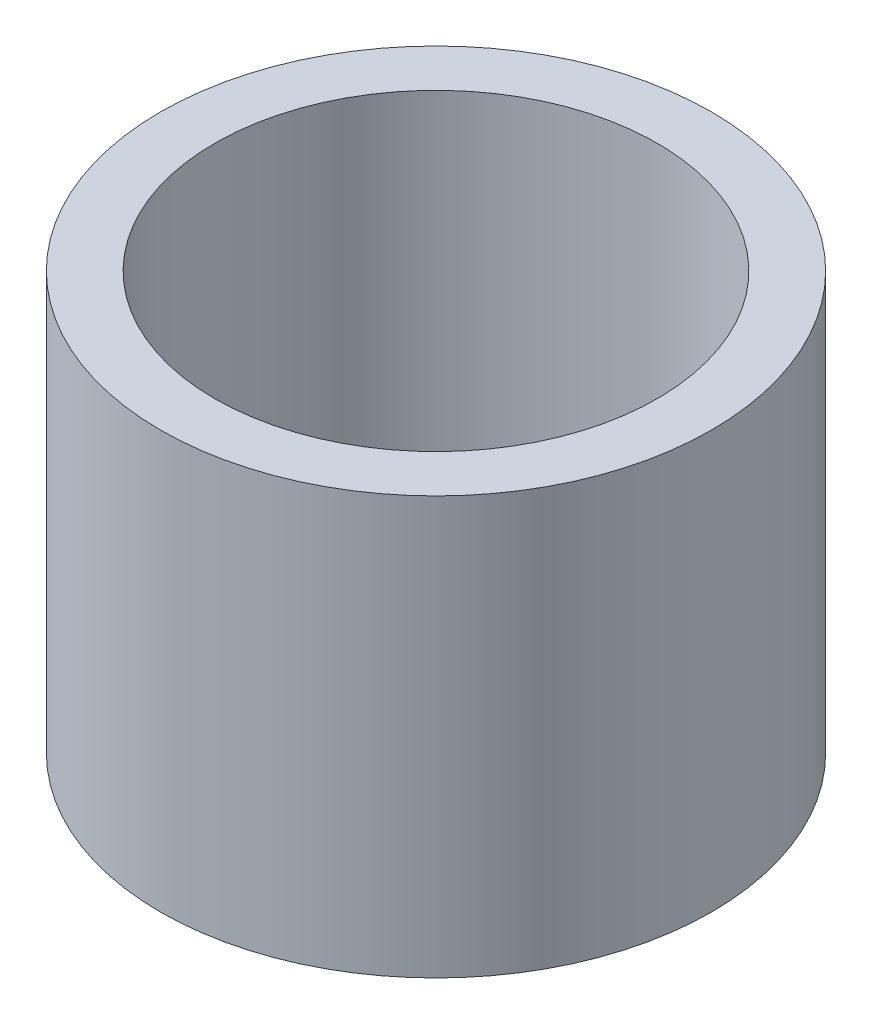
ISO-10303-21;
HEADER;
FILE_DESCRIPTION(('STEP AP214'),'2;1');
FILE_NAME('part.step','',(''),(''),'','','');
FILE_SCHEMA(('AUTOMOTIVE_DESIGN { 1 0 10303 214 1 1 1 1 }'));
ENDSEC;
DATA;
#1=APPLICATION_CONTEXT('core data for automotive mechanical design processes');
#2=APPLICATION_PROTOCOL_DEFINITION('international standard','automotive_design',2000,#1);
#3=PRODUCT_CONTEXT('',#1,'mechanical');
#4=PRODUCT('Part','Part','',(#3));
#5=PRODUCT_RELATED_PRODUCT_CATEGORY('part','',(#4));
#6=PRODUCT_DEFINITION_FORMATION('','',#4);
#7=PRODUCT_DEFINITION_CONTEXT('part definition',#1,'design');
#8=PRODUCT_DEFINITION('design','',#6,#7);
#9=PRODUCT_DEFINITION_SHAPE('','',#8);
#10=(LENGTH_UNIT() NAMED_UNIT(*) SI_UNIT(.MILLI.,.METRE.));
#11=(NAMED_UNIT(*) PLANE_ANGLE_UNIT() SI_UNIT($,.RADIAN.));
#12=(NAMED_UNIT(*) SI_UNIT($,.STERADIAN.) SOLID_ANGLE_UNIT());
#13=UNCERTAINTY_MEASURE_WITH_UNIT(LENGTH_MEASURE(1.E-05),#10,'distance_accuracy_value','');
#14=(GEOMETRIC_REPRESENTATION_CONTEXT(3) GLOBAL_UNCERTAINTY_ASSIGNED_CONTEXT((#13)) GLOBAL_UNIT_ASSIGNED_CONTEXT((#10,
#11,#12)) REPRESENTATION_CONTEXT('',''));
#15=CARTESIAN_POINT('',(0.,0.,0.));
#16=DIRECTION('',(0.,0.,1.));
#17=DIRECTION('',(1.,0.,0.));
#18=AXIS2_PLACEMENT_3D('',#15,#16,#17);
#19=CARTESIAN_POINT('',(0.,5.,0.));
#20=DIRECTION('',(0.,1.,0.));
#21=DIRECTION('',(0.,0.,1.));
#22=AXIS2_PLACEMENT_3D('',#19,#20,#21);
#23=PLANE('',#22);
#24=CARTESIAN_POINT('',(0.,5.,0.));
#25=DIRECTION('',(0.,1.,0.));
#26=DIRECTION('',(0.,0.,1.));
#27=AXIS2_PLACEMENT_3D('',#24,#25,#26);
#28=CIRCLE('',#27,3.3);
#29=CARTESIAN_POINT('',(0.,5.,3.3));
#30=VERTEX_POINT('',#29);
#31=EDGE_CURVE('E10',#30,#30,#28,.T.);
#32=ORIENTED_EDGE('',*,*,#31,.T.);
#33=EDGE_LOOP('',(#32));
#34=FACE_BOUND('',#33,.T.);
#35=CARTESIAN_POINT('',(0.,5.,0.));
#36=DIRECTION('',(0.,1.,0.));
#37=DIRECTION('',(0.,0.,1.));
#38=AXIS2_PLACEMENT_3D('',#35,#36,#37);
#39=CIRCLE('',#38,2.65);
#40=CARTESIAN_POINT('',(0.,5.,2.65));
#41=VERTEX_POINT('',#40);
#42=EDGE_CURVE('E56',#41,#41,#39,.T.);
#43=ORIENTED_EDGE('',*,*,#42,.F.);
#44=EDGE_LOOP('',(#43));
#45=FACE_BOUND('',#44,.T.);
#46=ADVANCED_FACE('F43',(#34,#45),#23,.T.);
#47=CARTESIAN_POINT('',(0.,0.,0.));
#48=DIRECTION('',(0.,1.,0.));
#49=DIRECTION('',(0.,0.,1.));
#50=AXIS2_PLACEMENT_3D('',#47,#48,#49);
#51=PLANE('',#50);
#52=CARTESIAN_POINT('',(0.,0.,0.));
#53=DIRECTION('',(0.,1.,0.));
#54=DIRECTION('',(0.,0.,1.));
#55=AXIS2_PLACEMENT_3D('',#52,#53,#54);
#56=CIRCLE('',#55,3.3);
#57=CARTESIAN_POINT('',(0.,0.,3.3));
#58=VERTEX_POINT('',#57);
#59=EDGE_CURVE('E47',#58,#58,#56,.T.);
#60=ORIENTED_EDGE('',*,*,#59,.F.);
#61=EDGE_LOOP('',(#60));
#62=FACE_BOUND('',#61,.T.);
#63=CARTESIAN_POINT('',(0.,0.,0.));
#64=DIRECTION('',(0.,1.,0.));
#65=DIRECTION('',(0.,0.,1.));
#66=AXIS2_PLACEMENT_3D('',#63,#64,#65);
#67=CIRCLE('',#66,2.65);
#68=CARTESIAN_POINT('',(0.,0.,2.65));
#69=VERTEX_POINT('',#68);
#70=EDGE_CURVE('E58',#69,#69,#67,.T.);
#71=ORIENTED_EDGE('',*,*,#70,.T.);
#72=EDGE_LOOP('',(#71));
#73=FACE_BOUND('',#72,.T.);
#74=ADVANCED_FACE('F70',(#62,#73),#51,.F.);
#75=CARTESIAN_POINT('',(0.,5.,0.));
#76=DIRECTION('',(0.,-1.,0.));
#77=DIRECTION('',(0.,0.,-1.));
#78=AXIS2_PLACEMENT_3D('',#75,#76,#77);
#79=CYLINDRICAL_SURFACE('',#78,3.3);
#80=ORIENTED_EDGE('',*,*,#31,.F.);
#81=EDGE_LOOP('',(#80));
#82=FACE_BOUND('',#81,.T.);
#83=ORIENTED_EDGE('',*,*,#59,.T.);
#84=EDGE_LOOP('',(#83));
#85=FACE_BOUND('',#84,.T.);
#86=ADVANCED_FACE('F45',(#82,#85),#79,.T.);
#87=CARTESIAN_POINT('',(0.,5.,0.));
#88=DIRECTION('',(0.,-1.,0.));
#89=DIRECTION('',(0.,0.,-1.));
#90=AXIS2_PLACEMENT_3D('',#87,#88,#89);
#91=CYLINDRICAL_SURFACE('',#90,2.65);
#92=ORIENTED_EDGE('',*,*,#42,.T.);
#93=EDGE_LOOP('',(#92));
#94=FACE_BOUND('',#93,.T.);
#95=ORIENTED_EDGE('',*,*,#70,.F.);
#96=EDGE_LOOP('',(#95));
#97=FACE_BOUND('',#96,.T.);
#98=ADVANCED_FACE('F66',(#94,#97),#91,.F.);
#99=CLOSED_SHELL('',(#46,#74,#86,#98));
#100=MANIFOLD_SOLID_BREP('B2',#99);
#101=ADVANCED_BREP_SHAPE_REPRESENTATION('',(#18,#100),#14);
#102=SHAPE_DEFINITION_REPRESENTATION(#9,#101);
ENDSEC;
END-ISO-10303-21;
